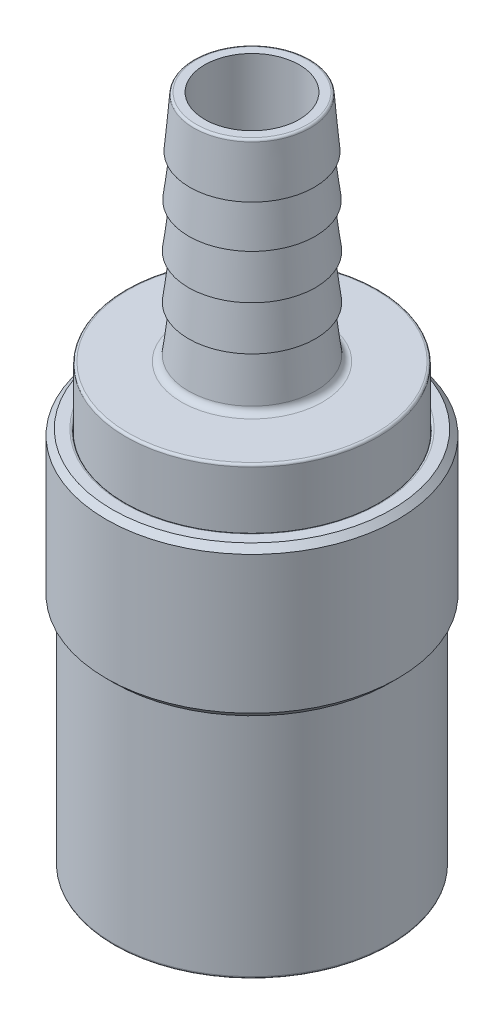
ISO-10303-21;
HEADER;
FILE_DESCRIPTION(('STEP AP214'),'2;1');
FILE_NAME('part.step','',(''),(''),'','','');
FILE_SCHEMA(('AUTOMOTIVE_DESIGN { 1 0 10303 214 1 1 1 1 }'));
ENDSEC;
DATA;
#1=APPLICATION_CONTEXT('core data for automotive mechanical design processes');
#2=APPLICATION_PROTOCOL_DEFINITION('international standard','automotive_design',2000,#1);
#3=PRODUCT_CONTEXT('',#1,'mechanical');
#4=PRODUCT('Part','Part','',(#3));
#5=PRODUCT_RELATED_PRODUCT_CATEGORY('part','',(#4));
#6=PRODUCT_DEFINITION_FORMATION('','',#4);
#7=PRODUCT_DEFINITION_CONTEXT('part definition',#1,'design');
#8=PRODUCT_DEFINITION('design','',#6,#7);
#9=PRODUCT_DEFINITION_SHAPE('','',#8);
#10=(LENGTH_UNIT() NAMED_UNIT(*) SI_UNIT(.MILLI.,.METRE.));
#11=(NAMED_UNIT(*) PLANE_ANGLE_UNIT() SI_UNIT($,.RADIAN.));
#12=(NAMED_UNIT(*) SI_UNIT($,.STERADIAN.) SOLID_ANGLE_UNIT());
#13=UNCERTAINTY_MEASURE_WITH_UNIT(LENGTH_MEASURE(1.E-05),#10,'distance_accuracy_value','');
#14=(GEOMETRIC_REPRESENTATION_CONTEXT(3) GLOBAL_UNCERTAINTY_ASSIGNED_CONTEXT((#13)) GLOBAL_UNIT_ASSIGNED_CONTEXT((#10,
#11,#12)) REPRESENTATION_CONTEXT('',''));
#15=CARTESIAN_POINT('',(0.,0.,0.));
#16=DIRECTION('',(0.,0.,1.));
#17=DIRECTION('',(1.,0.,0.));
#18=AXIS2_PLACEMENT_3D('',#15,#16,#17);
#19=CARTESIAN_POINT('',(0.,0.508,0.));
#20=DIRECTION('',(0.,-1.,0.));
#21=DIRECTION('',(0.,0.,1.));
#22=AXIS2_PLACEMENT_3D('',#19,#20,#21);
#23=CONICAL_SURFACE('',#22,10.541,0.785398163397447);
#24=CARTESIAN_POINT('',(0.,1.016,0.));
#25=DIRECTION('',(0.,1.,0.));
#26=DIRECTION('',(0.,0.,1.));
#27=AXIS2_PLACEMENT_3D('',#24,#25,#26);
#28=CIRCLE('',#27,10.033);
#29=CARTESIAN_POINT('',(0.,1.016,-10.033));
#30=VERTEX_POINT('',#29);
#31=CARTESIAN_POINT('',(0.,1.016,10.033));
#32=VERTEX_POINT('',#31);
#33=EDGE_CURVE('P0_E11',#30,#32,#28,.T.);
#34=ORIENTED_EDGE('',*,*,#33,.T.);
#35=CARTESIAN_POINT('',(0.,1.016,0.));
#36=DIRECTION('',(0.,1.,0.));
#37=DIRECTION('',(0.,0.,1.));
#38=AXIS2_PLACEMENT_3D('',#35,#36,#37);
#39=CIRCLE('',#38,10.033);
#40=EDGE_CURVE('P0_E27',#32,#30,#39,.T.);
#41=ORIENTED_EDGE('',*,*,#40,.T.);
#42=DIRECTION('',(0.,-0.707106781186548,-0.707106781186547));
#43=VECTOR('',#42,1.);
#44=CARTESIAN_POINT('',(0.,0.508,-10.541));
#45=LINE('',#44,#43);
#46=CARTESIAN_POINT('',(0.,0.,-11.049));
#47=VERTEX_POINT('',#46);
#48=EDGE_CURVE('P0_E302',#30,#47,#45,.T.);
#49=ORIENTED_EDGE('',*,*,#48,.T.);
#50=CARTESIAN_POINT('',(0.,0.,0.));
#51=DIRECTION('',(0.,-1.,0.));
#52=DIRECTION('',(0.,0.,1.));
#53=AXIS2_PLACEMENT_3D('',#50,#51,#52);
#54=CIRCLE('',#53,11.049);
#55=EDGE_CURVE('P0_E298',#47,#47,#54,.T.);
#56=ORIENTED_EDGE('',*,*,#55,.T.);
#57=ORIENTED_EDGE('',*,*,#48,.F.);
#58=EDGE_LOOP('',(#34,#41,#49,#56,#57));
#59=FACE_BOUND('',#58,.T.);
#60=ADVANCED_FACE('P0_F16',(#59),#23,.F.);
#61=CARTESIAN_POINT('',(0.,0.,-10.033));
#62=DIRECTION('',(0.,-1.,0.));
#63=DIRECTION('',(0.,0.,-1.));
#64=AXIS2_PLACEMENT_3D('',#61,#62,#63);
#65=PLANE('',#64);
#66=CARTESIAN_POINT('',(0.,0.,0.));
#67=DIRECTION('',(0.,1.,0.));
#68=DIRECTION('',(0.,0.,1.));
#69=AXIS2_PLACEMENT_3D('',#66,#67,#68);
#70=CIRCLE('',#69,11.8618);
#71=CARTESIAN_POINT('',(0.,0.,-11.8618));
#72=VERTEX_POINT('',#71);
#73=CARTESIAN_POINT('',(0.,0.,11.8618));
#74=VERTEX_POINT('',#73);
#75=EDGE_CURVE('P0_E371',#72,#74,#70,.T.);
#76=ORIENTED_EDGE('',*,*,#75,.F.);
#77=CARTESIAN_POINT('',(0.,0.,0.));
#78=DIRECTION('',(0.,1.,0.));
#79=DIRECTION('',(0.,0.,1.));
#80=AXIS2_PLACEMENT_3D('',#77,#78,#79);
#81=CIRCLE('',#80,11.8618);
#82=EDGE_CURVE('P0_E304',#74,#72,#81,.T.);
#83=ORIENTED_EDGE('',*,*,#82,.F.);
#84=EDGE_LOOP('',(#76,#83));
#85=FACE_BOUND('',#84,.T.);
#86=ORIENTED_EDGE('',*,*,#55,.F.);
#87=EDGE_LOOP('',(#86));
#88=FACE_BOUND('',#87,.T.);
#89=ADVANCED_FACE('P0_F780',(#85,#88),#65,.T.);
#90=CARTESIAN_POINT('',(0.,8.5344,0.));
#91=DIRECTION('',(0.,-1.,0.));
#92=DIRECTION('',(0.,0.,-1.));
#93=AXIS2_PLACEMENT_3D('',#90,#91,#92);
#94=CYLINDRICAL_SURFACE('',#93,10.033);
#95=ORIENTED_EDGE('',*,*,#33,.F.);
#96=ORIENTED_EDGE('',*,*,#40,.F.);
#97=DIRECTION('',(0.,1.,0.));
#98=VECTOR('',#97,1.);
#99=CARTESIAN_POINT('',(0.,8.5344,10.033));
#100=LINE('',#99,#98);
#101=CARTESIAN_POINT('',(0.,17.0688,10.033));
#102=VERTEX_POINT('',#101);
#103=EDGE_CURVE('P0_E303',#32,#102,#100,.T.);
#104=ORIENTED_EDGE('',*,*,#103,.T.);
#105=CARTESIAN_POINT('',(0.,17.0688,0.));
#106=DIRECTION('',(0.,-1.,0.));
#107=DIRECTION('',(1.,0.,0.));
#108=AXIS2_PLACEMENT_3D('',#105,#106,#107);
#109=CIRCLE('',#108,10.033);
#110=CARTESIAN_POINT('',(0.,17.0688,-10.033));
#111=VERTEX_POINT('',#110);
#112=EDGE_CURVE('P0_E297',#111,#102,#109,.T.);
#113=ORIENTED_EDGE('',*,*,#112,.F.);
#114=CARTESIAN_POINT('',(0.,17.0688,0.));
#115=DIRECTION('',(0.,-1.,0.));
#116=DIRECTION('',(1.,0.,0.));
#117=AXIS2_PLACEMENT_3D('',#114,#115,#116);
#118=CIRCLE('',#117,10.033);
#119=EDGE_CURVE('P0_E411',#102,#111,#118,.T.);
#120=ORIENTED_EDGE('',*,*,#119,.F.);
#121=ORIENTED_EDGE('',*,*,#103,.F.);
#122=EDGE_LOOP('',(#95,#96,#104,#113,#120,#121));
#123=FACE_BOUND('',#122,.T.);
#124=ADVANCED_FACE('P0_F787',(#123),#94,.F.);
#125=CARTESIAN_POINT('',(0.,48.387,0.));
#126=DIRECTION('',(0.,-1.,0.));
#127=DIRECTION('',(0.,0.,-1.));
#128=AXIS2_PLACEMENT_3D('',#125,#126,#127);
#129=TOROIDAL_SURFACE('',#128,7.6802016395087,0.762);
#130=CARTESIAN_POINT('',(0.,48.298698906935,0.));
#131=DIRECTION('',(0.,-1.,0.));
#132=DIRECTION('',(0.,0.,1.));
#133=AXIS2_PLACEMENT_3D('',#130,#131,#132);
#134=CIRCLE('',#133,6.92333512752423);
#135=CARTESIAN_POINT('',(0.,48.298698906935,-6.92333512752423));
#136=VERTEX_POINT('',#135);
#137=CARTESIAN_POINT('',(0.,48.298698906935,6.92333512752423));
#138=VERTEX_POINT('',#137);
#139=EDGE_CURVE('P0_E339',#136,#138,#134,.T.);
#140=ORIENTED_EDGE('',*,*,#139,.T.);
#141=CARTESIAN_POINT('',(0.,48.387,7.6802016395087));
#142=DIRECTION('',(-1.,0.,0.));
#143=DIRECTION('',(0.,0.,1.));
#144=AXIS2_PLACEMENT_3D('',#141,#142,#143);
#145=CIRCLE('',#144,0.762);
#146=CARTESIAN_POINT('',(0.,47.625,7.6802016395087));
#147=VERTEX_POINT('',#146);
#148=EDGE_CURVE('P0_E382',#138,#147,#145,.T.);
#149=ORIENTED_EDGE('',*,*,#148,.T.);
#150=CARTESIAN_POINT('',(0.,47.625,0.));
#151=DIRECTION('',(0.,1.,0.));
#152=DIRECTION('',(0.,0.,1.));
#153=AXIS2_PLACEMENT_3D('',#150,#151,#152);
#154=CIRCLE('',#153,7.6802016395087);
#155=CARTESIAN_POINT('',(0.,47.625,-7.6802016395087));
#156=VERTEX_POINT('',#155);
#157=EDGE_CURVE('P0_E434',#147,#156,#154,.T.);
#158=ORIENTED_EDGE('',*,*,#157,.T.);
#159=CARTESIAN_POINT('',(0.,47.625,0.));
#160=DIRECTION('',(0.,1.,0.));
#161=DIRECTION('',(0.,0.,1.));
#162=AXIS2_PLACEMENT_3D('',#159,#160,#161);
#163=CIRCLE('',#162,7.6802016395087);
#164=EDGE_CURVE('P0_E336',#156,#147,#163,.T.);
#165=ORIENTED_EDGE('',*,*,#164,.T.);
#166=ORIENTED_EDGE('',*,*,#148,.F.);
#167=CARTESIAN_POINT('',(0.,48.298698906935,0.));
#168=DIRECTION('',(0.,-1.,0.));
#169=DIRECTION('',(0.,0.,1.));
#170=AXIS2_PLACEMENT_3D('',#167,#168,#169);
#171=CIRCLE('',#170,6.92333512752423);
#172=EDGE_CURVE('P0_E332',#138,#136,#171,.T.);
#173=ORIENTED_EDGE('',*,*,#172,.T.);
#174=EDGE_LOOP('',(#140,#149,#158,#165,#166,#173));
#175=FACE_BOUND('',#174,.T.);
#176=ADVANCED_FACE('P0_F531',(#175),#129,.F.);
#177=CARTESIAN_POINT('',(0.,47.625,-13.7414));
#178=DIRECTION('',(0.,1.,0.));
#179=DIRECTION('',(1.,0.,0.));
#180=AXIS2_PLACEMENT_3D('',#177,#178,#179);
#181=PLANE('',#180);
#182=CARTESIAN_POINT('',(0.,47.625,0.));
#183=DIRECTION('',(0.,-1.,0.));
#184=DIRECTION('',(0.,0.,1.));
#185=AXIS2_PLACEMENT_3D('',#182,#183,#184);
#186=CIRCLE('',#185,13.4874);
#187=CARTESIAN_POINT('',(0.,47.625,-13.4874));
#188=VERTEX_POINT('',#187);
#189=CARTESIAN_POINT('',(0.,47.625,13.4874));
#190=VERTEX_POINT('',#189);
#191=EDGE_CURVE('P0_E276',#188,#190,#186,.T.);
#192=ORIENTED_EDGE('',*,*,#191,.F.);
#193=CARTESIAN_POINT('',(0.,47.625,0.));
#194=DIRECTION('',(0.,-1.,0.));
#195=DIRECTION('',(0.,0.,1.));
#196=AXIS2_PLACEMENT_3D('',#193,#194,#195);
#197=CIRCLE('',#196,13.4874);
#198=EDGE_CURVE('P0_E284',#190,#188,#197,.T.);
#199=ORIENTED_EDGE('',*,*,#198,.F.);
#200=EDGE_LOOP('',(#192,#199));
#201=FACE_BOUND('',#200,.T.);
#202=ORIENTED_EDGE('',*,*,#164,.F.);
#203=ORIENTED_EDGE('',*,*,#157,.F.);
#204=EDGE_LOOP('',(#202,#203));
#205=FACE_BOUND('',#204,.T.);
#206=ADVANCED_FACE('P0_F527',(#201,#205),#181,.T.);
#207=CARTESIAN_POINT('',(0.,50.419,0.));
#208=DIRECTION('',(0.,-1.,0.));
#209=DIRECTION('',(0.,0.,-1.));
#210=AXIS2_PLACEMENT_3D('',#207,#208,#209);
#211=CONICAL_SURFACE('',#210,6.67596666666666,0.116141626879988);
#212=ORIENTED_EDGE('',*,*,#139,.F.);
#213=ORIENTED_EDGE('',*,*,#172,.F.);
#214=DIRECTION('',(0.,0.993263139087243,-0.115880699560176));
#215=VECTOR('',#214,1.);
#216=CARTESIAN_POINT('',(0.,50.419,6.67596666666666));
#217=LINE('',#216,#215);
#218=CARTESIAN_POINT('',(0.,53.213,6.35));
#219=VERTEX_POINT('',#218);
#220=EDGE_CURVE('P0_E337',#138,#219,#217,.T.);
#221=ORIENTED_EDGE('',*,*,#220,.T.);
#222=CARTESIAN_POINT('',(0.,53.213,0.));
#223=DIRECTION('',(0.,-1.,0.));
#224=DIRECTION('',(1.,0.,0.));
#225=AXIS2_PLACEMENT_3D('',#222,#223,#224);
#226=CIRCLE('',#225,6.35);
#227=CARTESIAN_POINT('',(0.,53.213,-6.35));
#228=VERTEX_POINT('',#227);
#229=EDGE_CURVE('P0_E370',#219,#228,#226,.T.);
#230=ORIENTED_EDGE('',*,*,#229,.T.);
#231=CARTESIAN_POINT('',(0.,53.213,0.));
#232=DIRECTION('',(0.,-1.,0.));
#233=DIRECTION('',(1.,0.,0.));
#234=AXIS2_PLACEMENT_3D('',#231,#232,#233);
#235=CIRCLE('',#234,6.35);
#236=EDGE_CURVE('P0_E366',#228,#219,#235,.T.);
#237=ORIENTED_EDGE('',*,*,#236,.T.);
#238=ORIENTED_EDGE('',*,*,#220,.F.);
#239=EDGE_LOOP('',(#212,#213,#221,#230,#237,#238));
#240=FACE_BOUND('',#239,.T.);
#241=ADVANCED_FACE('P0_F530',(#240),#211,.T.);
#242=CARTESIAN_POINT('',(0.,0.254,0.));
#243=DIRECTION('',(0.,-1.,0.));
#244=DIRECTION('',(0.,0.,-1.));
#245=AXIS2_PLACEMENT_3D('',#242,#243,#244);
#246=TOROIDAL_SURFACE('',#245,11.8618,0.254);
#247=ORIENTED_EDGE('',*,*,#75,.T.);
#248=CARTESIAN_POINT('',(0.,0.254,11.8618));
#249=DIRECTION('',(-1.,0.,0.));
#250=DIRECTION('',(0.,0.,1.));
#251=AXIS2_PLACEMENT_3D('',#248,#249,#250);
#252=CIRCLE('',#251,0.254);
#253=CARTESIAN_POINT('',(0.,0.254,12.1158));
#254=VERTEX_POINT('',#253);
#255=EDGE_CURVE('P0_E426',#74,#254,#252,.T.);
#256=ORIENTED_EDGE('',*,*,#255,.T.);
#257=CARTESIAN_POINT('',(0.,0.254,0.));
#258=DIRECTION('',(0.,-1.,0.));
#259=DIRECTION('',(0.,0.,1.));
#260=AXIS2_PLACEMENT_3D('',#257,#258,#259);
#261=CIRCLE('',#260,12.1158);
#262=CARTESIAN_POINT('',(0.,0.254,-12.1158));
#263=VERTEX_POINT('',#262);
#264=EDGE_CURVE('P0_E331',#254,#263,#261,.T.);
#265=ORIENTED_EDGE('',*,*,#264,.T.);
#266=CARTESIAN_POINT('',(0.,0.254,0.));
#267=DIRECTION('',(0.,-1.,0.));
#268=DIRECTION('',(0.,0.,1.));
#269=AXIS2_PLACEMENT_3D('',#266,#267,#268);
#270=CIRCLE('',#269,12.1158);
#271=EDGE_CURVE('P0_E308',#263,#254,#270,.T.);
#272=ORIENTED_EDGE('',*,*,#271,.T.);
#273=ORIENTED_EDGE('',*,*,#255,.F.);
#274=ORIENTED_EDGE('',*,*,#82,.T.);
#275=EDGE_LOOP('',(#247,#256,#265,#272,#273,#274));
#276=FACE_BOUND('',#275,.T.);
#277=ADVANCED_FACE('P0_F794',(#276),#246,.T.);
#278=CARTESIAN_POINT('',(0.,8.1153,0.));
#279=DIRECTION('',(0.,-1.,0.));
#280=DIRECTION('',(0.,0.,-1.));
#281=AXIS2_PLACEMENT_3D('',#278,#279,#280);
#282=CYLINDRICAL_SURFACE('',#281,12.1158);
#283=ORIENTED_EDGE('',*,*,#271,.F.);
#284=ORIENTED_EDGE('',*,*,#264,.F.);
#285=DIRECTION('',(0.,1.,0.));
#286=VECTOR('',#285,1.);
#287=CARTESIAN_POINT('',(0.,8.1153,12.1158));
#288=LINE('',#287,#286);
#289=CARTESIAN_POINT('',(0.,16.2306,12.1158));
#290=VERTEX_POINT('',#289);
#291=EDGE_CURVE('P0_E309',#254,#290,#288,.T.);
#292=ORIENTED_EDGE('',*,*,#291,.T.);
#293=CARTESIAN_POINT('',(0.,16.2306,0.));
#294=DIRECTION('',(0.,-1.,0.));
#295=DIRECTION('',(1.,0.,0.));
#296=AXIS2_PLACEMENT_3D('',#293,#294,#295);
#297=CIRCLE('',#296,12.1158);
#298=CARTESIAN_POINT('',(0.,16.2306,-12.1158));
#299=VERTEX_POINT('',#298);
#300=EDGE_CURVE('P0_E344',#290,#299,#297,.T.);
#301=ORIENTED_EDGE('',*,*,#300,.T.);
#302=CARTESIAN_POINT('',(0.,16.2306,0.));
#303=DIRECTION('',(0.,-1.,0.));
#304=DIRECTION('',(1.,0.,0.));
#305=AXIS2_PLACEMENT_3D('',#302,#303,#304);
#306=CIRCLE('',#305,12.1158);
#307=EDGE_CURVE('P0_E359',#299,#290,#306,.T.);
#308=ORIENTED_EDGE('',*,*,#307,.T.);
#309=ORIENTED_EDGE('',*,*,#291,.F.);
#310=EDGE_LOOP('',(#283,#284,#292,#301,#308,#309));
#311=FACE_BOUND('',#310,.T.);
#312=ADVANCED_FACE('P0_F800',(#311),#282,.T.);
#313=CARTESIAN_POINT('',(0.,16.4846,0.));
#314=DIRECTION('',(0.,-1.,0.));
#315=DIRECTION('',(0.,0.,-1.));
#316=AXIS2_PLACEMENT_3D('',#313,#314,#315);
#317=TOROIDAL_SURFACE('',#316,13.4874,0.254);
#318=CARTESIAN_POINT('',(0.,16.2306,0.));
#319=DIRECTION('',(0.,1.,0.));
#320=DIRECTION('',(0.,0.,1.));
#321=AXIS2_PLACEMENT_3D('',#318,#319,#320);
#322=CIRCLE('',#321,13.4874);
#323=CARTESIAN_POINT('',(0.,16.2306,-13.4874));
#324=VERTEX_POINT('',#323);
#325=CARTESIAN_POINT('',(0.,16.2306,13.4874));
#326=VERTEX_POINT('',#325);
#327=EDGE_CURVE('P0_E355',#324,#326,#322,.T.);
#328=ORIENTED_EDGE('',*,*,#327,.T.);
#329=CARTESIAN_POINT('',(0.,16.4846,13.4874));
#330=DIRECTION('',(-1.,0.,0.));
#331=DIRECTION('',(0.,0.,1.));
#332=AXIS2_PLACEMENT_3D('',#329,#330,#331);
#333=CIRCLE('',#332,0.254);
#334=CARTESIAN_POINT('',(0.,16.4846,13.7414));
#335=VERTEX_POINT('',#334);
#336=EDGE_CURVE('P0_E360',#326,#335,#333,.T.);
#337=ORIENTED_EDGE('',*,*,#336,.T.);
#338=CARTESIAN_POINT('',(0.,16.4846,0.));
#339=DIRECTION('',(0.,-1.,0.));
#340=DIRECTION('',(0.,0.,1.));
#341=AXIS2_PLACEMENT_3D('',#338,#339,#340);
#342=CIRCLE('',#341,13.7414);
#343=CARTESIAN_POINT('',(0.,16.4846,-13.7414));
#344=VERTEX_POINT('',#343);
#345=EDGE_CURVE('P0_E430',#335,#344,#342,.T.);
#346=ORIENTED_EDGE('',*,*,#345,.T.);
#347=CARTESIAN_POINT('',(0.,16.4846,0.));
#348=DIRECTION('',(0.,-1.,0.));
#349=DIRECTION('',(0.,0.,1.));
#350=AXIS2_PLACEMENT_3D('',#347,#348,#349);
#351=CIRCLE('',#350,13.7414);
#352=EDGE_CURVE('P0_E500',#344,#335,#351,.T.);
#353=ORIENTED_EDGE('',*,*,#352,.T.);
#354=ORIENTED_EDGE('',*,*,#336,.F.);
#355=CARTESIAN_POINT('',(0.,16.2306,0.));
#356=DIRECTION('',(0.,1.,0.));
#357=DIRECTION('',(0.,0.,1.));
#358=AXIS2_PLACEMENT_3D('',#355,#356,#357);
#359=CIRCLE('',#358,13.4874);
#360=EDGE_CURVE('P0_E479',#326,#324,#359,.T.);
#361=ORIENTED_EDGE('',*,*,#360,.T.);
#362=EDGE_LOOP('',(#328,#337,#346,#353,#354,#361));
#363=FACE_BOUND('',#362,.T.);
#364=ADVANCED_FACE('P0_F837',(#363),#317,.T.);
#365=CARTESIAN_POINT('',(0.,31.9278,0.));
#366=DIRECTION('',(0.,-1.,0.));
#367=DIRECTION('',(0.,0.,-1.));
#368=AXIS2_PLACEMENT_3D('',#365,#366,#367);
#369=CYLINDRICAL_SURFACE('',#368,13.7414);
#370=ORIENTED_EDGE('',*,*,#352,.F.);
#371=ORIENTED_EDGE('',*,*,#345,.F.);
#372=DIRECTION('',(0.,1.,0.));
#373=VECTOR('',#372,1.);
#374=CARTESIAN_POINT('',(0.,31.9278,13.7414));
#375=LINE('',#374,#373);
#376=CARTESIAN_POINT('',(0.,47.371,13.7414));
#377=VERTEX_POINT('',#376);
#378=EDGE_CURVE('P0_E267',#335,#377,#375,.T.);
#379=ORIENTED_EDGE('',*,*,#378,.T.);
#380=CARTESIAN_POINT('',(0.,47.371,0.));
#381=DIRECTION('',(0.,1.,0.));
#382=DIRECTION('',(0.,0.,1.));
#383=AXIS2_PLACEMENT_3D('',#380,#381,#382);
#384=CIRCLE('',#383,13.7414);
#385=CARTESIAN_POINT('',(0.,47.371,-13.7414));
#386=VERTEX_POINT('',#385);
#387=EDGE_CURVE('P0_E263',#386,#377,#384,.T.);
#388=ORIENTED_EDGE('',*,*,#387,.F.);
#389=CARTESIAN_POINT('',(0.,47.371,0.));
#390=DIRECTION('',(0.,1.,0.));
#391=DIRECTION('',(0.,0.,1.));
#392=AXIS2_PLACEMENT_3D('',#389,#390,#391);
#393=CIRCLE('',#392,13.7414);
#394=EDGE_CURVE('P0_E258',#377,#386,#393,.T.);
#395=ORIENTED_EDGE('',*,*,#394,.F.);
#396=ORIENTED_EDGE('',*,*,#378,.F.);
#397=EDGE_LOOP('',(#370,#371,#379,#388,#395,#396));
#398=FACE_BOUND('',#397,.T.);
#399=ADVANCED_FACE('P0_F265',(#398),#369,.T.);
#400=CARTESIAN_POINT('',(0.,16.2306,-12.1158));
#401=DIRECTION('',(0.,-1.,0.));
#402=DIRECTION('',(0.,0.,-1.));
#403=AXIS2_PLACEMENT_3D('',#400,#401,#402);
#404=PLANE('',#403);
#405=ORIENTED_EDGE('',*,*,#327,.F.);
#406=ORIENTED_EDGE('',*,*,#360,.F.);
#407=EDGE_LOOP('',(#405,#406));
#408=FACE_BOUND('',#407,.T.);
#409=ORIENTED_EDGE('',*,*,#307,.F.);
#410=ORIENTED_EDGE('',*,*,#300,.F.);
#411=EDGE_LOOP('',(#409,#410));
#412=FACE_BOUND('',#411,.T.);
#413=ADVANCED_FACE('P0_F823',(#408,#412),#404,.T.);
#414=CARTESIAN_POINT('',(0.,47.371,0.));
#415=DIRECTION('',(0.,-1.,0.));
#416=DIRECTION('',(0.,0.,-1.));
#417=AXIS2_PLACEMENT_3D('',#414,#415,#416);
#418=TOROIDAL_SURFACE('',#417,13.4874,0.254);
#419=ORIENTED_EDGE('',*,*,#387,.T.);
#420=CARTESIAN_POINT('',(0.,47.371,13.4874));
#421=DIRECTION('',(-1.,0.,0.));
#422=DIRECTION('',(0.,0.,1.));
#423=AXIS2_PLACEMENT_3D('',#420,#421,#422);
#424=CIRCLE('',#423,0.254);
#425=EDGE_CURVE('P0_E272',#377,#190,#424,.T.);
#426=ORIENTED_EDGE('',*,*,#425,.T.);
#427=ORIENTED_EDGE('',*,*,#198,.T.);
#428=ORIENTED_EDGE('',*,*,#191,.T.);
#429=ORIENTED_EDGE('',*,*,#425,.F.);
#430=ORIENTED_EDGE('',*,*,#394,.T.);
#431=EDGE_LOOP('',(#419,#426,#427,#428,#429,#430));
#432=FACE_BOUND('',#431,.T.);
#433=ADVANCED_FACE('P0_F274',(#432),#418,.T.);
#434=CARTESIAN_POINT('',(0.,72.771,0.));
#435=DIRECTION('',(0.,-1.,0.));
#436=DIRECTION('',(0.,0.,-1.));
#437=AXIS2_PLACEMENT_3D('',#434,#435,#436);
#438=TOROIDAL_SURFACE('',#437,6.08023053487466,0.254);
#439=CARTESIAN_POINT('',(0.,72.79219630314,0.));
#440=DIRECTION('',(0.,1.,0.));
#441=DIRECTION('',(0.,0.,1.));
#442=AXIS2_PLACEMENT_3D('',#439,#440,#441);
#443=CIRCLE('',#442,6.3333445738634);
#444=CARTESIAN_POINT('',(0.,72.79219630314,-6.3333445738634));
#445=VERTEX_POINT('',#444);
#446=CARTESIAN_POINT('',(0.,72.79219630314,6.3333445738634));
#447=VERTEX_POINT('',#446);
#448=EDGE_CURVE('P0_E277',#445,#447,#443,.T.);
#449=ORIENTED_EDGE('',*,*,#448,.T.);
#450=CARTESIAN_POINT('',(0.,72.771,6.08023053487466));
#451=DIRECTION('',(-1.,0.,0.));
#452=DIRECTION('',(0.,0.,1.));
#453=AXIS2_PLACEMENT_3D('',#450,#451,#452);
#454=CIRCLE('',#453,0.254);
#455=CARTESIAN_POINT('',(0.,73.025,6.08023053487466));
#456=VERTEX_POINT('',#455);
#457=EDGE_CURVE('P0_E287',#447,#456,#454,.T.);
#458=ORIENTED_EDGE('',*,*,#457,.T.);
#459=CARTESIAN_POINT('',(0.,73.025,0.));
#460=DIRECTION('',(0.,-1.,0.));
#461=DIRECTION('',(0.,0.,1.));
#462=AXIS2_PLACEMENT_3D('',#459,#460,#461);
#463=CIRCLE('',#462,6.08023053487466);
#464=CARTESIAN_POINT('',(0.,73.025,-6.08023053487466));
#465=VERTEX_POINT('',#464);
#466=EDGE_CURVE('P0_E440',#456,#465,#463,.T.);
#467=ORIENTED_EDGE('',*,*,#466,.T.);
#468=CARTESIAN_POINT('',(0.,73.025,0.));
#469=DIRECTION('',(0.,-1.,0.));
#470=DIRECTION('',(0.,0.,1.));
#471=AXIS2_PLACEMENT_3D('',#468,#469,#470);
#472=CIRCLE('',#471,6.08023053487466);
#473=EDGE_CURVE('P0_E443',#465,#456,#472,.T.);
#474=ORIENTED_EDGE('',*,*,#473,.T.);
#475=ORIENTED_EDGE('',*,*,#457,.F.);
#476=CARTESIAN_POINT('',(0.,72.79219630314,0.));
#477=DIRECTION('',(0.,1.,0.));
#478=DIRECTION('',(0.,0.,1.));
#479=AXIS2_PLACEMENT_3D('',#476,#477,#478);
#480=CIRCLE('',#479,6.3333445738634);
#481=EDGE_CURVE('P0_E291',#447,#445,#480,.T.);
#482=ORIENTED_EDGE('',*,*,#481,.T.);
#483=EDGE_LOOP('',(#449,#458,#467,#474,#475,#482));
#484=FACE_BOUND('',#483,.T.);
#485=ADVANCED_FACE('P0_F822',(#484),#438,.T.);
#486=CARTESIAN_POINT('',(0.,73.025,-6.31384910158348));
#487=DIRECTION('',(0.,1.,0.));
#488=DIRECTION('',(1.,0.,0.));
#489=AXIS2_PLACEMENT_3D('',#486,#487,#488);
#490=PLANE('',#489);
#491=ORIENTED_EDGE('',*,*,#473,.F.);
#492=ORIENTED_EDGE('',*,*,#466,.F.);
#493=EDGE_LOOP('',(#491,#492));
#494=FACE_BOUND('',#493,.T.);
#495=CARTESIAN_POINT('',(0.,73.025,0.));
#496=DIRECTION('',(0.,-1.,0.));
#497=DIRECTION('',(1.,0.,0.));
#498=AXIS2_PLACEMENT_3D('',#495,#496,#497);
#499=CIRCLE('',#498,5.1562);
#500=CARTESIAN_POINT('',(0.,73.025,-5.1562));
#501=VERTEX_POINT('',#500);
#502=CARTESIAN_POINT('',(0.,73.025,5.1562));
#503=VERTEX_POINT('',#502);
#504=EDGE_CURVE('P0_E494',#501,#503,#499,.T.);
#505=ORIENTED_EDGE('',*,*,#504,.T.);
#506=CARTESIAN_POINT('',(0.,73.025,0.));
#507=DIRECTION('',(0.,-1.,0.));
#508=DIRECTION('',(1.,0.,0.));
#509=AXIS2_PLACEMENT_3D('',#506,#507,#508);
#510=CIRCLE('',#509,5.1562);
#511=EDGE_CURVE('P0_E386',#503,#501,#510,.T.);
#512=ORIENTED_EDGE('',*,*,#511,.T.);
#513=EDGE_LOOP('',(#505,#512));
#514=FACE_BOUND('',#513,.T.);
#515=ADVANCED_FACE('P0_F18',(#494,#514),#490,.T.);
#516=CARTESIAN_POINT('',(0.,70.231,0.));
#517=DIRECTION('',(0.,-1.,0.));
#518=DIRECTION('',(0.,0.,-1.));
#519=AXIS2_PLACEMENT_3D('',#516,#517,#518);
#520=CONICAL_SURFACE('',#519,6.54782455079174,0.0835471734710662);
#521=CARTESIAN_POINT('',(0.,67.437,0.));
#522=DIRECTION('',(0.,-1.,0.));
#523=DIRECTION('',(1.,0.,0.));
#524=AXIS2_PLACEMENT_3D('',#521,#522,#523);
#525=CIRCLE('',#524,6.7818);
#526=CARTESIAN_POINT('',(0.,67.437,-6.7818));
#527=VERTEX_POINT('',#526);
#528=CARTESIAN_POINT('',(0.,67.437,6.7818));
#529=VERTEX_POINT('',#528);
#530=EDGE_CURVE('P0_E321',#527,#529,#525,.T.);
#531=ORIENTED_EDGE('',*,*,#530,.F.);
#532=CARTESIAN_POINT('',(0.,67.437,0.));
#533=DIRECTION('',(0.,-1.,0.));
#534=DIRECTION('',(1.,0.,0.));
#535=AXIS2_PLACEMENT_3D('',#532,#533,#534);
#536=CIRCLE('',#535,6.7818);
#537=EDGE_CURVE('P0_E326',#529,#527,#536,.T.);
#538=ORIENTED_EDGE('',*,*,#537,.F.);
#539=DIRECTION('',(0.,0.996511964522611,-0.0834500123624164));
#540=VECTOR('',#539,1.);
#541=CARTESIAN_POINT('',(0.,70.231,6.54782455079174));
#542=LINE('',#541,#540);
#543=EDGE_CURVE('P0_E353',#529,#447,#542,.T.);
#544=ORIENTED_EDGE('',*,*,#543,.T.);
#545=ORIENTED_EDGE('',*,*,#448,.F.);
#546=ORIENTED_EDGE('',*,*,#481,.F.);
#547=ORIENTED_EDGE('',*,*,#543,.F.);
#548=EDGE_LOOP('',(#531,#538,#544,#545,#546,#547));
#549=FACE_BOUND('',#548,.T.);
#550=ADVANCED_FACE('P0_F819',(#549),#520,.T.);
#551=CARTESIAN_POINT('',(0.,27.8638,0.));
#552=DIRECTION('',(0.,-1.,0.));
#553=DIRECTION('',(0.,0.,-1.));
#554=AXIS2_PLACEMENT_3D('',#551,#552,#553);
#555=CYLINDRICAL_SURFACE('',#554,7.9248);
#556=CARTESIAN_POINT('',(0.,23.9776,0.));
#557=DIRECTION('',(0.,-1.,0.));
#558=DIRECTION('',(1.,0.,0.));
#559=AXIS2_PLACEMENT_3D('',#556,#557,#558);
#560=CIRCLE('',#559,7.9248);
#561=CARTESIAN_POINT('',(0.,23.9776,-7.9248));
#562=VERTEX_POINT('',#561);
#563=CARTESIAN_POINT('',(0.,23.9776,7.9248));
#564=VERTEX_POINT('',#563);
#565=EDGE_CURVE('P0_E349',#562,#564,#560,.T.);
#566=ORIENTED_EDGE('',*,*,#565,.T.);
#567=DIRECTION('',(0.,1.,0.));
#568=VECTOR('',#567,1.);
#569=CARTESIAN_POINT('',(0.,27.8638,7.9248));
#570=LINE('',#569,#568);
#571=CARTESIAN_POINT('',(0.,31.75,7.9248));
#572=VERTEX_POINT('',#571);
#573=EDGE_CURVE('P0_E354',#564,#572,#570,.T.);
#574=ORIENTED_EDGE('',*,*,#573,.T.);
#575=CARTESIAN_POINT('',(0.,31.75,0.));
#576=DIRECTION('',(0.,-1.,0.));
#577=DIRECTION('',(1.,0.,0.));
#578=AXIS2_PLACEMENT_3D('',#575,#576,#577);
#579=CIRCLE('',#578,7.9248);
#580=CARTESIAN_POINT('',(0.,31.75,-7.9248));
#581=VERTEX_POINT('',#580);
#582=EDGE_CURVE('P0_E379',#581,#572,#579,.T.);
#583=ORIENTED_EDGE('',*,*,#582,.F.);
#584=CARTESIAN_POINT('',(0.,31.75,0.));
#585=DIRECTION('',(0.,-1.,0.));
#586=DIRECTION('',(1.,0.,0.));
#587=AXIS2_PLACEMENT_3D('',#584,#585,#586);
#588=CIRCLE('',#587,7.9248);
#589=EDGE_CURVE('P0_E482',#572,#581,#588,.T.);
#590=ORIENTED_EDGE('',*,*,#589,.F.);
#591=ORIENTED_EDGE('',*,*,#573,.F.);
#592=CARTESIAN_POINT('',(0.,23.9776,0.));
#593=DIRECTION('',(0.,-1.,0.));
#594=DIRECTION('',(1.,0.,0.));
#595=AXIS2_PLACEMENT_3D('',#592,#593,#594);
#596=CIRCLE('',#595,7.9248);
#597=EDGE_CURVE('P0_E375',#564,#562,#596,.T.);
#598=ORIENTED_EDGE('',*,*,#597,.T.);
#599=EDGE_LOOP('',(#566,#574,#583,#590,#591,#598));
#600=FACE_BOUND('',#599,.T.);
#601=ADVANCED_FACE('P0_F842',(#600),#555,.F.);
#602=CARTESIAN_POINT('',(0.,31.75,-5.1562));
#603=DIRECTION('',(0.,-1.,0.));
#604=DIRECTION('',(0.,0.,-1.));
#605=AXIS2_PLACEMENT_3D('',#602,#603,#604);
#606=PLANE('',#605);
#607=ORIENTED_EDGE('',*,*,#582,.T.);
#608=ORIENTED_EDGE('',*,*,#589,.T.);
#609=EDGE_LOOP('',(#607,#608));
#610=FACE_BOUND('',#609,.T.);
#611=CARTESIAN_POINT('',(0.,31.75,0.));
#612=DIRECTION('',(0.,-1.,0.));
#613=DIRECTION('',(1.,0.,0.));
#614=AXIS2_PLACEMENT_3D('',#611,#612,#613);
#615=CIRCLE('',#614,5.1562);
#616=CARTESIAN_POINT('',(0.,31.75,-5.1562));
#617=VERTEX_POINT('',#616);
#618=CARTESIAN_POINT('',(0.,31.75,5.1562));
#619=VERTEX_POINT('',#618);
#620=EDGE_CURVE('P0_E487',#617,#619,#615,.T.);
#621=ORIENTED_EDGE('',*,*,#620,.F.);
#622=CARTESIAN_POINT('',(0.,31.75,0.));
#623=DIRECTION('',(0.,-1.,0.));
#624=DIRECTION('',(1.,0.,0.));
#625=AXIS2_PLACEMENT_3D('',#622,#623,#624);
#626=CIRCLE('',#625,5.1562);
#627=EDGE_CURVE('P0_E325',#619,#617,#626,.T.);
#628=ORIENTED_EDGE('',*,*,#627,.F.);
#629=EDGE_LOOP('',(#621,#628));
#630=FACE_BOUND('',#629,.T.);
#631=ADVANCED_FACE('P0_F742',(#610,#630),#606,.T.);
#632=CARTESIAN_POINT('',(0.,52.3875,0.));
#633=DIRECTION('',(0.,-1.,0.));
#634=DIRECTION('',(0.,0.,-1.));
#635=AXIS2_PLACEMENT_3D('',#632,#633,#634);
#636=CYLINDRICAL_SURFACE('',#635,5.1562);
#637=ORIENTED_EDGE('',*,*,#620,.T.);
#638=DIRECTION('',(0.,1.,0.));
#639=VECTOR('',#638,1.);
#640=CARTESIAN_POINT('',(0.,52.3875,5.1562));
#641=LINE('',#640,#639);
#642=EDGE_CURVE('P0_E483',#619,#503,#641,.T.);
#643=ORIENTED_EDGE('',*,*,#642,.T.);
#644=ORIENTED_EDGE('',*,*,#504,.F.);
#645=ORIENTED_EDGE('',*,*,#511,.F.);
#646=ORIENTED_EDGE('',*,*,#642,.F.);
#647=ORIENTED_EDGE('',*,*,#627,.T.);
#648=EDGE_LOOP('',(#637,#643,#644,#645,#646,#647));
#649=FACE_BOUND('',#648,.T.);
#650=ADVANCED_FACE('P0_F740',(#649),#636,.F.);
#651=CARTESIAN_POINT('',(0.,67.437,-6.35));
#652=DIRECTION('',(0.,-1.,0.));
#653=DIRECTION('',(0.,0.,-1.));
#654=AXIS2_PLACEMENT_3D('',#651,#652,#653);
#655=PLANE('',#654);
#656=ORIENTED_EDGE('',*,*,#530,.T.);
#657=ORIENTED_EDGE('',*,*,#537,.T.);
#658=EDGE_LOOP('',(#656,#657));
#659=FACE_BOUND('',#658,.T.);
#660=CARTESIAN_POINT('',(0.,67.437,0.));
#661=DIRECTION('',(0.,-1.,0.));
#662=DIRECTION('',(1.,0.,0.));
#663=AXIS2_PLACEMENT_3D('',#660,#661,#662);
#664=CIRCLE('',#663,6.35);
#665=CARTESIAN_POINT('',(0.,67.437,-6.35));
#666=VERTEX_POINT('',#665);
#667=CARTESIAN_POINT('',(0.,67.437,6.35));
#668=VERTEX_POINT('',#667);
#669=EDGE_CURVE('P0_E315',#666,#668,#664,.T.);
#670=ORIENTED_EDGE('',*,*,#669,.F.);
#671=CARTESIAN_POINT('',(0.,67.437,0.));
#672=DIRECTION('',(0.,-1.,0.));
#673=DIRECTION('',(1.,0.,0.));
#674=AXIS2_PLACEMENT_3D('',#671,#672,#673);
#675=CIRCLE('',#674,6.35);
#676=EDGE_CURVE('P0_E310',#668,#666,#675,.T.);
#677=ORIENTED_EDGE('',*,*,#676,.F.);
#678=EDGE_LOOP('',(#670,#677));
#679=FACE_BOUND('',#678,.T.);
#680=ADVANCED_FACE('P0_F751',(#659,#679),#655,.T.);
#681=CARTESIAN_POINT('',(0.,65.151,0.));
#682=DIRECTION('',(0.,-1.,0.));
#683=DIRECTION('',(0.,0.,-1.));
#684=AXIS2_PLACEMENT_3D('',#681,#682,#683);
#685=CONICAL_SURFACE('',#684,6.6167,0.116141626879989);
#686=CARTESIAN_POINT('',(0.,62.865,0.));
#687=DIRECTION('',(0.,-1.,0.));
#688=DIRECTION('',(1.,0.,0.));
#689=AXIS2_PLACEMENT_3D('',#686,#687,#688);
#690=CIRCLE('',#689,6.8834);
#691=CARTESIAN_POINT('',(0.,62.865,-6.8834));
#692=VERTEX_POINT('',#691);
#693=CARTESIAN_POINT('',(0.,62.865,6.8834));
#694=VERTEX_POINT('',#693);
#695=EDGE_CURVE('P0_E348',#692,#694,#690,.T.);
#696=ORIENTED_EDGE('',*,*,#695,.F.);
#697=CARTESIAN_POINT('',(0.,62.865,0.));
#698=DIRECTION('',(0.,-1.,0.));
#699=DIRECTION('',(1.,0.,0.));
#700=AXIS2_PLACEMENT_3D('',#697,#698,#699);
#701=CIRCLE('',#700,6.8834);
#702=EDGE_CURVE('P0_E319',#694,#692,#701,.T.);
#703=ORIENTED_EDGE('',*,*,#702,.F.);
#704=DIRECTION('',(0.,0.993263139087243,-0.115880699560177));
#705=VECTOR('',#704,1.);
#706=CARTESIAN_POINT('',(0.,65.151,6.6167));
#707=LINE('',#706,#705);
#708=EDGE_CURVE('P0_E314',#694,#668,#707,.T.);
#709=ORIENTED_EDGE('',*,*,#708,.T.);
#710=ORIENTED_EDGE('',*,*,#676,.T.);
#711=ORIENTED_EDGE('',*,*,#669,.T.);
#712=ORIENTED_EDGE('',*,*,#708,.F.);
#713=EDGE_LOOP('',(#696,#703,#709,#710,#711,#712));
#714=FACE_BOUND('',#713,.T.);
#715=ADVANCED_FACE('P0_F754',(#714),#685,.T.);
#716=CARTESIAN_POINT('',(0.,62.865,-6.35));
#717=DIRECTION('',(0.,-1.,0.));
#718=DIRECTION('',(0.,0.,-1.));
#719=AXIS2_PLACEMENT_3D('',#716,#717,#718);
#720=PLANE('',#719);
#721=ORIENTED_EDGE('',*,*,#695,.T.);
#722=ORIENTED_EDGE('',*,*,#702,.T.);
#723=EDGE_LOOP('',(#721,#722));
#724=FACE_BOUND('',#723,.T.);
#725=CARTESIAN_POINT('',(0.,62.865,0.));
#726=DIRECTION('',(0.,-1.,0.));
#727=DIRECTION('',(1.,0.,0.));
#728=AXIS2_PLACEMENT_3D('',#725,#726,#727);
#729=CIRCLE('',#728,6.35);
#730=CARTESIAN_POINT('',(0.,62.865,-6.35));
#731=VERTEX_POINT('',#730);
#732=CARTESIAN_POINT('',(0.,62.865,6.35));
#733=VERTEX_POINT('',#732);
#734=EDGE_CURVE('P0_E395',#731,#733,#729,.T.);
#735=ORIENTED_EDGE('',*,*,#734,.F.);
#736=CARTESIAN_POINT('',(0.,62.865,0.));
#737=DIRECTION('',(0.,-1.,0.));
#738=DIRECTION('',(1.,0.,0.));
#739=AXIS2_PLACEMENT_3D('',#736,#737,#738);
#740=CIRCLE('',#739,6.35);
#741=EDGE_CURVE('P0_E320',#733,#731,#740,.T.);
#742=ORIENTED_EDGE('',*,*,#741,.F.);
#743=EDGE_LOOP('',(#735,#742));
#744=FACE_BOUND('',#743,.T.);
#745=ADVANCED_FACE('P0_F756',(#724,#744),#720,.T.);
#746=CARTESIAN_POINT('',(0.,60.452,0.));
#747=DIRECTION('',(0.,-1.,0.));
#748=DIRECTION('',(0.,0.,-1.));
#749=AXIS2_PLACEMENT_3D('',#746,#747,#748);
#750=CONICAL_SURFACE('',#749,6.63151666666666,0.116141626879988);
#751=CARTESIAN_POINT('',(0.,58.039,0.));
#752=DIRECTION('',(0.,-1.,0.));
#753=DIRECTION('',(1.,0.,0.));
#754=AXIS2_PLACEMENT_3D('',#751,#752,#753);
#755=CIRCLE('',#754,6.91303333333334);
#756=CARTESIAN_POINT('',(0.,58.039,-6.91303333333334));
#757=VERTEX_POINT('',#756);
#758=CARTESIAN_POINT('',(0.,58.039,6.91303333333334));
#759=VERTEX_POINT('',#758);
#760=EDGE_CURVE('P0_E388',#757,#759,#755,.T.);
#761=ORIENTED_EDGE('',*,*,#760,.F.);
#762=CARTESIAN_POINT('',(0.,58.039,0.));
#763=DIRECTION('',(0.,-1.,0.));
#764=DIRECTION('',(1.,0.,0.));
#765=AXIS2_PLACEMENT_3D('',#762,#763,#764);
#766=CIRCLE('',#765,6.91303333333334);
#767=EDGE_CURVE('P0_E232',#759,#757,#766,.T.);
#768=ORIENTED_EDGE('',*,*,#767,.F.);
#769=DIRECTION('',(0.,0.993263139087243,-0.115880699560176));
#770=VECTOR('',#769,1.);
#771=CARTESIAN_POINT('',(0.,60.452,6.63151666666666));
#772=LINE('',#771,#770);
#773=EDGE_CURVE('P0_E316',#759,#733,#772,.T.);
#774=ORIENTED_EDGE('',*,*,#773,.T.);
#775=ORIENTED_EDGE('',*,*,#741,.T.);
#776=ORIENTED_EDGE('',*,*,#734,.T.);
#777=ORIENTED_EDGE('',*,*,#773,.F.);
#778=EDGE_LOOP('',(#761,#768,#774,#775,#776,#777));
#779=FACE_BOUND('',#778,.T.);
#780=ADVANCED_FACE('P0_F759',(#779),#750,.T.);
#781=CARTESIAN_POINT('',(0.,58.039,-6.35));
#782=DIRECTION('',(0.,-1.,0.));
#783=DIRECTION('',(0.,0.,-1.));
#784=AXIS2_PLACEMENT_3D('',#781,#782,#783);
#785=PLANE('',#784);
#786=ORIENTED_EDGE('',*,*,#760,.T.);
#787=ORIENTED_EDGE('',*,*,#767,.T.);
#788=EDGE_LOOP('',(#786,#787));
#789=FACE_BOUND('',#788,.T.);
#790=CARTESIAN_POINT('',(0.,58.039,0.));
#791=DIRECTION('',(0.,-1.,0.));
#792=DIRECTION('',(1.,0.,0.));
#793=AXIS2_PLACEMENT_3D('',#790,#791,#792);
#794=CIRCLE('',#793,6.35);
#795=CARTESIAN_POINT('',(0.,58.039,-6.35));
#796=VERTEX_POINT('',#795);
#797=CARTESIAN_POINT('',(0.,58.039,6.35));
#798=VERTEX_POINT('',#797);
#799=EDGE_CURVE('P0_E242',#796,#798,#794,.T.);
#800=ORIENTED_EDGE('',*,*,#799,.F.);
#801=CARTESIAN_POINT('',(0.,58.039,0.));
#802=DIRECTION('',(0.,-1.,0.));
#803=DIRECTION('',(1.,0.,0.));
#804=AXIS2_PLACEMENT_3D('',#801,#802,#803);
#805=CIRCLE('',#804,6.35);
#806=EDGE_CURVE('P0_E374',#798,#796,#805,.T.);
#807=ORIENTED_EDGE('',*,*,#806,.F.);
#808=EDGE_LOOP('',(#800,#807));
#809=FACE_BOUND('',#808,.T.);
#810=ADVANCED_FACE('P0_F764',(#789,#809),#785,.T.);
#811=CARTESIAN_POINT('',(0.,55.626,0.));
#812=DIRECTION('',(0.,-1.,0.));
#813=DIRECTION('',(0.,0.,-1.));
#814=AXIS2_PLACEMENT_3D('',#811,#812,#813);
#815=CONICAL_SURFACE('',#814,6.63151666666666,0.116141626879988);
#816=CARTESIAN_POINT('',(0.,53.213,0.));
#817=DIRECTION('',(0.,-1.,0.));
#818=DIRECTION('',(1.,0.,0.));
#819=AXIS2_PLACEMENT_3D('',#816,#817,#818);
#820=CIRCLE('',#819,6.91303333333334);
#821=CARTESIAN_POINT('',(0.,53.213,-6.91303333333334));
#822=VERTEX_POINT('',#821);
#823=CARTESIAN_POINT('',(0.,53.213,6.91303333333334));
#824=VERTEX_POINT('',#823);
#825=EDGE_CURVE('P0_E20',#822,#824,#820,.T.);
#826=ORIENTED_EDGE('',*,*,#825,.F.);
#827=CARTESIAN_POINT('',(0.,53.213,0.));
#828=DIRECTION('',(0.,-1.,0.));
#829=DIRECTION('',(1.,0.,0.));
#830=AXIS2_PLACEMENT_3D('',#827,#828,#829);
#831=CIRCLE('',#830,6.91303333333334);
#832=EDGE_CURVE('P0_E293',#824,#822,#831,.T.);
#833=ORIENTED_EDGE('',*,*,#832,.F.);
#834=DIRECTION('',(0.,0.993263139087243,-0.115880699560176));
#835=VECTOR('',#834,1.);
#836=CARTESIAN_POINT('',(0.,55.626,6.63151666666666));
#837=LINE('',#836,#835);
#838=EDGE_CURVE('P0_E389',#824,#798,#837,.T.);
#839=ORIENTED_EDGE('',*,*,#838,.T.);
#840=ORIENTED_EDGE('',*,*,#806,.T.);
#841=ORIENTED_EDGE('',*,*,#799,.T.);
#842=ORIENTED_EDGE('',*,*,#838,.F.);
#843=EDGE_LOOP('',(#826,#833,#839,#840,#841,#842));
#844=FACE_BOUND('',#843,.T.);
#845=ADVANCED_FACE('P0_F766',(#844),#815,.T.);
#846=CARTESIAN_POINT('',(0.,53.213,-6.35));
#847=DIRECTION('',(0.,-1.,0.));
#848=DIRECTION('',(0.,0.,-1.));
#849=AXIS2_PLACEMENT_3D('',#846,#847,#848);
#850=PLANE('',#849);
#851=ORIENTED_EDGE('',*,*,#825,.T.);
#852=ORIENTED_EDGE('',*,*,#832,.T.);
#853=EDGE_LOOP('',(#851,#852));
#854=FACE_BOUND('',#853,.T.);
#855=ORIENTED_EDGE('',*,*,#236,.F.);
#856=ORIENTED_EDGE('',*,*,#229,.F.);
#857=EDGE_LOOP('',(#855,#856));
#858=FACE_BOUND('',#857,.T.);
#859=ADVANCED_FACE('P0_F774',(#854,#858),#850,.T.);
#860=CARTESIAN_POINT('',(0.,17.3863,0.));
#861=DIRECTION('',(0.,1.,0.));
#862=DIRECTION('',(0.,0.,-1.));
#863=AXIS2_PLACEMENT_3D('',#860,#861,#862);
#864=CONICAL_SURFACE('',#863,10.3505,0.78539816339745);
#865=ORIENTED_EDGE('',*,*,#112,.T.);
#866=DIRECTION('',(0.,0.707106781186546,0.707106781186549));
#867=VECTOR('',#866,1.);
#868=CARTESIAN_POINT('',(0.,17.3863,10.3505));
#869=LINE('',#868,#867);
#870=CARTESIAN_POINT('',(0.,17.7038,10.668));
#871=VERTEX_POINT('',#870);
#872=EDGE_CURVE('P0_E407',#102,#871,#869,.T.);
#873=ORIENTED_EDGE('',*,*,#872,.T.);
#874=CARTESIAN_POINT('',(0.,17.7038,0.));
#875=DIRECTION('',(0.,-1.,0.));
#876=DIRECTION('',(1.,0.,0.));
#877=AXIS2_PLACEMENT_3D('',#874,#875,#876);
#878=CIRCLE('',#877,10.668);
#879=CARTESIAN_POINT('',(0.,17.7038,-10.668));
#880=VERTEX_POINT('',#879);
#881=EDGE_CURVE('P0_E450',#880,#871,#878,.T.);
#882=ORIENTED_EDGE('',*,*,#881,.F.);
#883=CARTESIAN_POINT('',(0.,17.7038,0.));
#884=DIRECTION('',(0.,-1.,0.));
#885=DIRECTION('',(1.,0.,0.));
#886=AXIS2_PLACEMENT_3D('',#883,#884,#885);
#887=CIRCLE('',#886,10.668);
#888=EDGE_CURVE('P0_E364',#871,#880,#887,.T.);
#889=ORIENTED_EDGE('',*,*,#888,.F.);
#890=ORIENTED_EDGE('',*,*,#872,.F.);
#891=ORIENTED_EDGE('',*,*,#119,.T.);
#892=EDGE_LOOP('',(#865,#873,#882,#889,#890,#891));
#893=FACE_BOUND('',#892,.T.);
#894=ADVANCED_FACE('P0_F808',(#893),#864,.F.);
#895=CARTESIAN_POINT('',(0.,20.8407,0.));
#896=DIRECTION('',(0.,-1.,0.));
#897=DIRECTION('',(0.,0.,-1.));
#898=AXIS2_PLACEMENT_3D('',#895,#896,#897);
#899=CYLINDRICAL_SURFACE('',#898,10.668);
#900=ORIENTED_EDGE('',*,*,#881,.T.);
#901=DIRECTION('',(0.,1.,0.));
#902=VECTOR('',#901,1.);
#903=CARTESIAN_POINT('',(0.,20.8407,10.668));
#904=LINE('',#903,#902);
#905=CARTESIAN_POINT('',(0.,23.9776,10.668));
#906=VERTEX_POINT('',#905);
#907=EDGE_CURVE('P0_E446',#871,#906,#904,.T.);
#908=ORIENTED_EDGE('',*,*,#907,.T.);
#909=CARTESIAN_POINT('',(0.,23.9776,0.));
#910=DIRECTION('',(0.,-1.,0.));
#911=DIRECTION('',(1.,0.,0.));
#912=AXIS2_PLACEMENT_3D('',#909,#910,#911);
#913=CIRCLE('',#912,10.668);
#914=CARTESIAN_POINT('',(0.,23.9776,-10.668));
#915=VERTEX_POINT('',#914);
#916=EDGE_CURVE('P0_E361',#915,#906,#913,.T.);
#917=ORIENTED_EDGE('',*,*,#916,.F.);
#918=CARTESIAN_POINT('',(0.,23.9776,0.));
#919=DIRECTION('',(0.,-1.,0.));
#920=DIRECTION('',(1.,0.,0.));
#921=AXIS2_PLACEMENT_3D('',#918,#919,#920);
#922=CIRCLE('',#921,10.668);
#923=EDGE_CURVE('P0_E365',#906,#915,#922,.T.);
#924=ORIENTED_EDGE('',*,*,#923,.F.);
#925=ORIENTED_EDGE('',*,*,#907,.F.);
#926=ORIENTED_EDGE('',*,*,#888,.T.);
#927=EDGE_LOOP('',(#900,#908,#917,#924,#925,#926));
#928=FACE_BOUND('',#927,.T.);
#929=ADVANCED_FACE('P0_F815',(#928),#899,.F.);
#930=CARTESIAN_POINT('',(0.,23.9776,-7.9248));
#931=DIRECTION('',(0.,-1.,0.));
#932=DIRECTION('',(0.,0.,-1.));
#933=AXIS2_PLACEMENT_3D('',#930,#931,#932);
#934=PLANE('',#933);
#935=ORIENTED_EDGE('',*,*,#916,.T.);
#936=ORIENTED_EDGE('',*,*,#923,.T.);
#937=EDGE_LOOP('',(#935,#936));
#938=FACE_BOUND('',#937,.T.);
#939=ORIENTED_EDGE('',*,*,#565,.F.);
#940=ORIENTED_EDGE('',*,*,#597,.F.);
#941=EDGE_LOOP('',(#939,#940));
#942=FACE_BOUND('',#941,.T.);
#943=ADVANCED_FACE('P0_F846',(#938,#942),#934,.T.);
#944=CLOSED_SHELL('',(#60,#89,#124,#176,#206,#241,#277,#312,#364,#399,#413,#433,#485,#515,#550,
#601,#631,#650,#680,#715,#745,#780,#810,#845,#859,#894,#929,#943));
#945=MANIFOLD_SOLID_BREP('P0_B1',#944);
#946=CARTESIAN_POINT('',(0.,40.9575,0.));
#947=DIRECTION('',(0.,-1.,0.));
#948=DIRECTION('',(0.,0.,1.));
#949=AXIS2_PLACEMENT_3D('',#946,#947,#948);
#950=CONICAL_SURFACE('',#949,15.5448,0.785398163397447);
#951=CARTESIAN_POINT('',(0.,40.64,0.));
#952=DIRECTION('',(0.,1.,0.));
#953=DIRECTION('',(0.,0.,1.));
#954=AXIS2_PLACEMENT_3D('',#951,#952,#953);
#955=CIRCLE('',#954,15.8623);
#956=CARTESIAN_POINT('',(0.,40.64,-15.8623));
#957=VERTEX_POINT('',#956);
#958=CARTESIAN_POINT('',(0.,40.64,15.8623));
#959=VERTEX_POINT('',#958);
#960=EDGE_CURVE('P1_E10',#957,#959,#955,.T.);
#961=ORIENTED_EDGE('',*,*,#960,.T.);
#962=CARTESIAN_POINT('',(0.,40.64,0.));
#963=DIRECTION('',(0.,1.,0.));
#964=DIRECTION('',(0.,0.,1.));
#965=AXIS2_PLACEMENT_3D('',#962,#963,#964);
#966=CIRCLE('',#965,15.8623);
#967=EDGE_CURVE('P1_E26',#959,#957,#966,.T.);
#968=ORIENTED_EDGE('',*,*,#967,.T.);
#969=DIRECTION('',(0.,0.707106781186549,0.707106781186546));
#970=VECTOR('',#969,1.);
#971=CARTESIAN_POINT('',(0.,40.9575,-15.5448));
#972=LINE('',#971,#970);
#973=CARTESIAN_POINT('',(0.,41.275,-15.2273));
#974=VERTEX_POINT('',#973);
#975=EDGE_CURVE('P1_E232',#957,#974,#972,.T.);
#976=ORIENTED_EDGE('',*,*,#975,.T.);
#977=CARTESIAN_POINT('',(0.,41.275,0.));
#978=DIRECTION('',(0.,-1.,0.));
#979=DIRECTION('',(0.,0.,1.));
#980=AXIS2_PLACEMENT_3D('',#977,#978,#979);
#981=CIRCLE('',#980,15.2273);
#982=EDGE_CURVE('P1_E228',#974,#974,#981,.T.);
#983=ORIENTED_EDGE('',*,*,#982,.T.);
#984=ORIENTED_EDGE('',*,*,#975,.F.);
#985=EDGE_LOOP('',(#961,#968,#976,#983,#984));
#986=FACE_BOUND('',#985,.T.);
#987=ADVANCED_FACE('P1_F15',(#986),#950,.T.);
#988=CARTESIAN_POINT('',(0.,41.275,-15.8623));
#989=DIRECTION('',(0.,1.,0.));
#990=DIRECTION('',(1.,0.,0.));
#991=AXIS2_PLACEMENT_3D('',#988,#989,#990);
#992=PLANE('',#991);
#993=ORIENTED_EDGE('',*,*,#982,.F.);
#994=EDGE_LOOP('',(#993));
#995=FACE_BOUND('',#994,.T.);
#996=CARTESIAN_POINT('',(0.,41.275,0.));
#997=DIRECTION('',(0.,1.,0.));
#998=DIRECTION('',(0.,0.,1.));
#999=AXIS2_PLACEMENT_3D('',#996,#997,#998);
#1000=CIRCLE('',#999,14.0335);
#1001=CARTESIAN_POINT('',(0.,41.275,-14.0335));
#1002=VERTEX_POINT('',#1001);
#1003=CARTESIAN_POINT('',(0.,41.275,14.0335));
#1004=VERTEX_POINT('',#1003);
#1005=EDGE_CURVE('P1_E175',#1002,#1004,#1000,.T.);
#1006=ORIENTED_EDGE('',*,*,#1005,.F.);
#1007=CARTESIAN_POINT('',(0.,41.275,0.));
#1008=DIRECTION('',(0.,1.,0.));
#1009=DIRECTION('',(0.,0.,1.));
#1010=AXIS2_PLACEMENT_3D('',#1007,#1008,#1009);
#1011=CIRCLE('',#1010,14.0335);
#1012=EDGE_CURVE('P1_E227',#1004,#1002,#1011,.T.);
#1013=ORIENTED_EDGE('',*,*,#1012,.F.);
#1014=EDGE_LOOP('',(#1006,#1013));
#1015=FACE_BOUND('',#1014,.T.);
#1016=ADVANCED_FACE('P1_F401',(#995,#1015),#992,.T.);
#1017=CARTESIAN_POINT('',(0.,33.4645,0.));
#1018=DIRECTION('',(0.,-1.,0.));
#1019=DIRECTION('',(0.,0.,-1.));
#1020=AXIS2_PLACEMENT_3D('',#1017,#1018,#1019);
#1021=CYLINDRICAL_SURFACE('',#1020,15.8623);
#1022=CARTESIAN_POINT('',(0.,25.654,0.));
#1023=DIRECTION('',(0.,-1.,0.));
#1024=DIRECTION('',(1.,0.,0.));
#1025=AXIS2_PLACEMENT_3D('',#1022,#1023,#1024);
#1026=CIRCLE('',#1025,15.8623);
#1027=CARTESIAN_POINT('',(0.,25.654,-15.8623));
#1028=VERTEX_POINT('',#1027);
#1029=CARTESIAN_POINT('',(0.,25.654,15.8623));
#1030=VERTEX_POINT('',#1029);
#1031=EDGE_CURVE('P1_E222',#1028,#1030,#1026,.T.);
#1032=ORIENTED_EDGE('',*,*,#1031,.F.);
#1033=CARTESIAN_POINT('',(0.,25.654,0.));
#1034=DIRECTION('',(0.,-1.,0.));
#1035=DIRECTION('',(1.,0.,0.));
#1036=AXIS2_PLACEMENT_3D('',#1033,#1034,#1035);
#1037=CIRCLE('',#1036,15.8623);
#1038=EDGE_CURVE('P1_E218',#1030,#1028,#1037,.T.);
#1039=ORIENTED_EDGE('',*,*,#1038,.F.);
#1040=DIRECTION('',(0.,1.,0.));
#1041=VECTOR('',#1040,1.);
#1042=CARTESIAN_POINT('',(0.,33.4645,15.8623));
#1043=LINE('',#1042,#1041);
#1044=EDGE_CURVE('P1_E233',#1030,#959,#1043,.T.);
#1045=ORIENTED_EDGE('',*,*,#1044,.T.);
#1046=ORIENTED_EDGE('',*,*,#960,.F.);
#1047=ORIENTED_EDGE('',*,*,#967,.F.);
#1048=ORIENTED_EDGE('',*,*,#1044,.F.);
#1049=EDGE_LOOP('',(#1032,#1039,#1045,#1046,#1047,#1048));
#1050=FACE_BOUND('',#1049,.T.);
#1051=ADVANCED_FACE('P1_F392',(#1050),#1021,.T.);
#1052=CARTESIAN_POINT('',(0.,4.953,0.));
#1053=DIRECTION('',(0.,-1.,0.));
#1054=DIRECTION('',(0.,0.,-1.));
#1055=AXIS2_PLACEMENT_3D('',#1052,#1053,#1054);
#1056=TOROIDAL_SURFACE('',#1055,12.446,0.254);
#1057=CARTESIAN_POINT('',(0.,5.207,0.));
#1058=DIRECTION('',(0.,1.,0.));
#1059=DIRECTION('',(0.,0.,1.));
#1060=AXIS2_PLACEMENT_3D('',#1057,#1058,#1059);
#1061=CIRCLE('',#1060,12.446);
#1062=CARTESIAN_POINT('',(0.,5.207,-12.446));
#1063=VERTEX_POINT('',#1062);
#1064=CARTESIAN_POINT('',(0.,5.207,12.446));
#1065=VERTEX_POINT('',#1064);
#1066=EDGE_CURVE('P1_E19',#1063,#1065,#1061,.T.);
#1067=ORIENTED_EDGE('',*,*,#1066,.T.);
#1068=CARTESIAN_POINT('',(0.,4.953,12.446));
#1069=DIRECTION('',(-1.,0.,0.));
#1070=DIRECTION('',(0.,0.,1.));
#1071=AXIS2_PLACEMENT_3D('',#1068,#1069,#1070);
#1072=CIRCLE('',#1071,0.254);
#1073=CARTESIAN_POINT('',(0.,4.953,12.192));
#1074=VERTEX_POINT('',#1073);
#1075=EDGE_CURVE('P1_E215',#1065,#1074,#1072,.T.);
#1076=ORIENTED_EDGE('',*,*,#1075,.T.);
#1077=CARTESIAN_POINT('',(0.,4.953,0.));
#1078=DIRECTION('',(0.,-1.,0.));
#1079=DIRECTION('',(0.,0.,1.));
#1080=AXIS2_PLACEMENT_3D('',#1077,#1078,#1079);
#1081=CIRCLE('',#1080,12.192);
#1082=CARTESIAN_POINT('',(0.,4.953,-12.192));
#1083=VERTEX_POINT('',#1082);
#1084=EDGE_CURVE('P1_E157',#1074,#1083,#1081,.T.);
#1085=ORIENTED_EDGE('',*,*,#1084,.T.);
#1086=CARTESIAN_POINT('',(0.,4.953,0.));
#1087=DIRECTION('',(0.,-1.,0.));
#1088=DIRECTION('',(0.,0.,1.));
#1089=AXIS2_PLACEMENT_3D('',#1086,#1087,#1088);
#1090=CIRCLE('',#1089,12.192);
#1091=EDGE_CURVE('P1_E216',#1083,#1074,#1090,.T.);
#1092=ORIENTED_EDGE('',*,*,#1091,.T.);
#1093=ORIENTED_EDGE('',*,*,#1075,.F.);
#1094=CARTESIAN_POINT('',(0.,5.207,0.));
#1095=DIRECTION('',(0.,1.,0.));
#1096=DIRECTION('',(0.,0.,1.));
#1097=AXIS2_PLACEMENT_3D('',#1094,#1095,#1096);
#1098=CIRCLE('',#1097,12.446);
#1099=EDGE_CURVE('P1_E160',#1065,#1063,#1098,.T.);
#1100=ORIENTED_EDGE('',*,*,#1099,.T.);
#1101=EDGE_LOOP('',(#1067,#1076,#1085,#1092,#1093,#1100));
#1102=FACE_BOUND('',#1101,.T.);
#1103=ADVANCED_FACE('P1_F390',(#1102),#1056,.T.);
#1104=CARTESIAN_POINT('',(0.,2.6035,0.));
#1105=DIRECTION('',(0.,-1.,0.));
#1106=DIRECTION('',(0.,0.,-1.));
#1107=AXIS2_PLACEMENT_3D('',#1104,#1105,#1106);
#1108=CYLINDRICAL_SURFACE('',#1107,12.192);
#1109=CARTESIAN_POINT('',(0.,0.254,0.));
#1110=DIRECTION('',(0.,1.,0.));
#1111=DIRECTION('',(0.,0.,1.));
#1112=AXIS2_PLACEMENT_3D('',#1109,#1110,#1111);
#1113=CIRCLE('',#1112,12.192);
#1114=CARTESIAN_POINT('',(0.,0.254,-12.192));
#1115=VERTEX_POINT('',#1114);
#1116=CARTESIAN_POINT('',(0.,0.254,12.192));
#1117=VERTEX_POINT('',#1116);
#1118=EDGE_CURVE('P1_E144',#1115,#1117,#1113,.T.);
#1119=ORIENTED_EDGE('',*,*,#1118,.F.);
#1120=CARTESIAN_POINT('',(0.,0.254,0.));
#1121=DIRECTION('',(0.,1.,0.));
#1122=DIRECTION('',(0.,0.,1.));
#1123=AXIS2_PLACEMENT_3D('',#1120,#1121,#1122);
#1124=CIRCLE('',#1123,12.192);
#1125=EDGE_CURVE('P1_E138',#1117,#1115,#1124,.T.);
#1126=ORIENTED_EDGE('',*,*,#1125,.F.);
#1127=DIRECTION('',(0.,1.,0.));
#1128=VECTOR('',#1127,1.);
#1129=CARTESIAN_POINT('',(0.,2.6035,12.192));
#1130=LINE('',#1129,#1128);
#1131=EDGE_CURVE('P1_E143',#1117,#1074,#1130,.T.);
#1132=ORIENTED_EDGE('',*,*,#1131,.T.);
#1133=ORIENTED_EDGE('',*,*,#1091,.F.);
#1134=ORIENTED_EDGE('',*,*,#1084,.F.);
#1135=ORIENTED_EDGE('',*,*,#1131,.F.);
#1136=EDGE_LOOP('',(#1119,#1126,#1132,#1133,#1134,#1135));
#1137=FACE_BOUND('',#1136,.T.);
#1138=ADVANCED_FACE('P1_F140',(#1137),#1108,.F.);
#1139=CARTESIAN_POINT('',(0.,5.207,-13.7795));
#1140=DIRECTION('',(0.,1.,0.));
#1141=DIRECTION('',(1.,0.,0.));
#1142=AXIS2_PLACEMENT_3D('',#1139,#1140,#1141);
#1143=PLANE('',#1142);
#1144=CARTESIAN_POINT('',(0.,5.207,0.));
#1145=DIRECTION('',(0.,-1.,0.));
#1146=DIRECTION('',(1.,0.,0.));
#1147=AXIS2_PLACEMENT_3D('',#1144,#1145,#1146);
#1148=CIRCLE('',#1147,13.7795);
#1149=CARTESIAN_POINT('',(0.,5.207,-13.7795));
#1150=VERTEX_POINT('',#1149);
#1151=CARTESIAN_POINT('',(0.,5.207,13.7795));
#1152=VERTEX_POINT('',#1151);
#1153=EDGE_CURVE('P1_E212',#1150,#1152,#1148,.T.);
#1154=ORIENTED_EDGE('',*,*,#1153,.F.);
#1155=CARTESIAN_POINT('',(0.,5.207,0.));
#1156=DIRECTION('',(0.,-1.,0.));
#1157=DIRECTION('',(1.,0.,0.));
#1158=AXIS2_PLACEMENT_3D('',#1155,#1156,#1157);
#1159=CIRCLE('',#1158,13.7795);
#1160=EDGE_CURVE('P1_E213',#1152,#1150,#1159,.T.);
#1161=ORIENTED_EDGE('',*,*,#1160,.F.);
#1162=EDGE_LOOP('',(#1154,#1161));
#1163=FACE_BOUND('',#1162,.T.);
#1164=ORIENTED_EDGE('',*,*,#1066,.F.);
#1165=ORIENTED_EDGE('',*,*,#1099,.F.);
#1166=EDGE_LOOP('',(#1164,#1165));
#1167=FACE_BOUND('',#1166,.T.);
#1168=ADVANCED_FACE('P1_F383',(#1163,#1167),#1143,.T.);
#1169=CARTESIAN_POINT('',(0.,0.254,0.));
#1170=DIRECTION('',(0.,-1.,0.));
#1171=DIRECTION('',(0.,0.,-1.));
#1172=AXIS2_PLACEMENT_3D('',#1169,#1170,#1171);
#1173=TOROIDAL_SURFACE('',#1172,12.446,0.254);
#1174=ORIENTED_EDGE('',*,*,#1118,.T.);
#1175=CARTESIAN_POINT('',(0.,0.254,12.446));
#1176=DIRECTION('',(-1.,0.,0.));
#1177=DIRECTION('',(0.,0.,1.));
#1178=AXIS2_PLACEMENT_3D('',#1175,#1176,#1177);
#1179=CIRCLE('',#1178,0.254);
#1180=CARTESIAN_POINT('',(0.,0.,12.446));
#1181=VERTEX_POINT('',#1180);
#1182=EDGE_CURVE('P1_E152',#1117,#1181,#1179,.T.);
#1183=ORIENTED_EDGE('',*,*,#1182,.T.);
#1184=CARTESIAN_POINT('',(0.,0.,0.));
#1185=DIRECTION('',(0.,-1.,0.));
#1186=DIRECTION('',(0.,0.,1.));
#1187=AXIS2_PLACEMENT_3D('',#1184,#1185,#1186);
#1188=CIRCLE('',#1187,12.446);
#1189=CARTESIAN_POINT('',(0.,0.,-12.446));
#1190=VERTEX_POINT('',#1189);
#1191=EDGE_CURVE('P1_E164',#1181,#1190,#1188,.T.);
#1192=ORIENTED_EDGE('',*,*,#1191,.T.);
#1193=CARTESIAN_POINT('',(0.,0.,0.));
#1194=DIRECTION('',(0.,-1.,0.));
#1195=DIRECTION('',(0.,0.,1.));
#1196=AXIS2_PLACEMENT_3D('',#1193,#1194,#1195);
#1197=CIRCLE('',#1196,12.446);
#1198=EDGE_CURVE('P1_E148',#1190,#1181,#1197,.T.);
#1199=ORIENTED_EDGE('',*,*,#1198,.T.);
#1200=ORIENTED_EDGE('',*,*,#1182,.F.);
#1201=ORIENTED_EDGE('',*,*,#1125,.T.);
#1202=EDGE_LOOP('',(#1174,#1183,#1192,#1199,#1200,#1201));
#1203=FACE_BOUND('',#1202,.T.);
#1204=ADVANCED_FACE('P1_F151',(#1203),#1173,.T.);
#1205=CARTESIAN_POINT('',(0.,0.,-12.192));
#1206=DIRECTION('',(0.,-1.,0.));
#1207=DIRECTION('',(0.,0.,-1.));
#1208=AXIS2_PLACEMENT_3D('',#1205,#1206,#1207);
#1209=PLANE('',#1208);
#1210=CARTESIAN_POINT('',(0.,0.,0.));
#1211=DIRECTION('',(0.,1.,0.));
#1212=DIRECTION('',(0.,0.,1.));
#1213=AXIS2_PLACEMENT_3D('',#1210,#1211,#1212);
#1214=CIRCLE('',#1213,14.8082);
#1215=CARTESIAN_POINT('',(0.,0.,-14.8082));
#1216=VERTEX_POINT('',#1215);
#1217=CARTESIAN_POINT('',(0.,0.,14.8082));
#1218=VERTEX_POINT('',#1217);
#1219=EDGE_CURVE('P1_E130',#1216,#1218,#1214,.T.);
#1220=ORIENTED_EDGE('',*,*,#1219,.F.);
#1221=CARTESIAN_POINT('',(0.,0.,0.));
#1222=DIRECTION('',(0.,1.,0.));
#1223=DIRECTION('',(0.,0.,1.));
#1224=AXIS2_PLACEMENT_3D('',#1221,#1222,#1223);
#1225=CIRCLE('',#1224,14.8082);
#1226=EDGE_CURVE('P1_E123',#1218,#1216,#1225,.T.);
#1227=ORIENTED_EDGE('',*,*,#1226,.F.);
#1228=EDGE_LOOP('',(#1220,#1227));
#1229=FACE_BOUND('',#1228,.T.);
#1230=ORIENTED_EDGE('',*,*,#1198,.F.);
#1231=ORIENTED_EDGE('',*,*,#1191,.F.);
#1232=EDGE_LOOP('',(#1230,#1231));
#1233=FACE_BOUND('',#1232,.T.);
#1234=ADVANCED_FACE('P1_F413',(#1229,#1233),#1209,.T.);
#1235=CARTESIAN_POINT('',(0.,0.254,0.));
#1236=DIRECTION('',(0.,-1.,0.));
#1237=DIRECTION('',(0.,0.,-1.));
#1238=AXIS2_PLACEMENT_3D('',#1235,#1236,#1237);
#1239=TOROIDAL_SURFACE('',#1238,14.8082,0.254);
#1240=ORIENTED_EDGE('',*,*,#1219,.T.);
#1241=CARTESIAN_POINT('',(0.,0.254,14.8082));
#1242=DIRECTION('',(-1.,0.,0.));
#1243=DIRECTION('',(0.,0.,1.));
#1244=AXIS2_PLACEMENT_3D('',#1241,#1242,#1243);
#1245=CIRCLE('',#1244,0.254);
#1246=CARTESIAN_POINT('',(0.,0.254,15.0622));
#1247=VERTEX_POINT('',#1246);
#1248=EDGE_CURVE('P1_E183',#1218,#1247,#1245,.T.);
#1249=ORIENTED_EDGE('',*,*,#1248,.T.);
#1250=CARTESIAN_POINT('',(0.,0.254,0.));
#1251=DIRECTION('',(0.,-1.,0.));
#1252=DIRECTION('',(0.,0.,1.));
#1253=AXIS2_PLACEMENT_3D('',#1250,#1251,#1252);
#1254=CIRCLE('',#1253,15.0622);
#1255=CARTESIAN_POINT('',(0.,0.254,-15.0622));
#1256=VERTEX_POINT('',#1255);
#1257=EDGE_CURVE('P1_E180',#1247,#1256,#1254,.T.);
#1258=ORIENTED_EDGE('',*,*,#1257,.T.);
#1259=CARTESIAN_POINT('',(0.,0.254,0.));
#1260=DIRECTION('',(0.,-1.,0.));
#1261=DIRECTION('',(0.,0.,1.));
#1262=AXIS2_PLACEMENT_3D('',#1259,#1260,#1261);
#1263=CIRCLE('',#1262,15.0622);
#1264=EDGE_CURVE('P1_E184',#1256,#1247,#1263,.T.);
#1265=ORIENTED_EDGE('',*,*,#1264,.T.);
#1266=ORIENTED_EDGE('',*,*,#1248,.F.);
#1267=ORIENTED_EDGE('',*,*,#1226,.T.);
#1268=EDGE_LOOP('',(#1240,#1249,#1258,#1265,#1266,#1267));
#1269=FACE_BOUND('',#1268,.T.);
#1270=ADVANCED_FACE('P1_F17',(#1269),#1239,.T.);
#1271=CARTESIAN_POINT('',(0.,12.42695,0.));
#1272=DIRECTION('',(0.,-1.,0.));
#1273=DIRECTION('',(0.,0.,-1.));
#1274=AXIS2_PLACEMENT_3D('',#1271,#1272,#1273);
#1275=CYLINDRICAL_SURFACE('',#1274,15.0622);
#1276=ORIENTED_EDGE('',*,*,#1264,.F.);
#1277=ORIENTED_EDGE('',*,*,#1257,.F.);
#1278=DIRECTION('',(0.,1.,0.));
#1279=VECTOR('',#1278,1.);
#1280=CARTESIAN_POINT('',(0.,12.42695,15.0622));
#1281=LINE('',#1280,#1279);
#1282=CARTESIAN_POINT('',(0.,24.8539,15.0622));
#1283=VERTEX_POINT('',#1282);
#1284=EDGE_CURVE('P1_E199',#1247,#1283,#1281,.T.);
#1285=ORIENTED_EDGE('',*,*,#1284,.T.);
#1286=CARTESIAN_POINT('',(0.,24.8539,0.));
#1287=DIRECTION('',(0.,-1.,0.));
#1288=DIRECTION('',(1.,0.,0.));
#1289=AXIS2_PLACEMENT_3D('',#1286,#1287,#1288);
#1290=CIRCLE('',#1289,15.0622);
#1291=CARTESIAN_POINT('',(0.,24.8539,-15.0622));
#1292=VERTEX_POINT('',#1291);
#1293=EDGE_CURVE('P1_E205',#1283,#1292,#1290,.T.);
#1294=ORIENTED_EDGE('',*,*,#1293,.T.);
#1295=CARTESIAN_POINT('',(0.,24.8539,0.));
#1296=DIRECTION('',(0.,-1.,0.));
#1297=DIRECTION('',(1.,0.,0.));
#1298=AXIS2_PLACEMENT_3D('',#1295,#1296,#1297);
#1299=CIRCLE('',#1298,15.0622);
#1300=EDGE_CURVE('P1_E178',#1292,#1283,#1299,.T.);
#1301=ORIENTED_EDGE('',*,*,#1300,.T.);
#1302=ORIENTED_EDGE('',*,*,#1284,.F.);
#1303=EDGE_LOOP('',(#1276,#1277,#1285,#1294,#1301,#1302));
#1304=FACE_BOUND('',#1303,.T.);
#1305=ADVANCED_FACE('P1_F269',(#1304),#1275,.T.);
#1306=CARTESIAN_POINT('',(0.,41.021,0.));
#1307=DIRECTION('',(0.,-1.,0.));
#1308=DIRECTION('',(0.,0.,-1.));
#1309=AXIS2_PLACEMENT_3D('',#1306,#1307,#1308);
#1310=TOROIDAL_SURFACE('',#1309,14.0335,0.254);
#1311=ORIENTED_EDGE('',*,*,#1005,.T.);
#1312=CARTESIAN_POINT('',(0.,41.021,14.0335));
#1313=DIRECTION('',(-1.,0.,0.));
#1314=DIRECTION('',(0.,0.,1.));
#1315=AXIS2_PLACEMENT_3D('',#1312,#1313,#1314);
#1316=CIRCLE('',#1315,0.254);
#1317=CARTESIAN_POINT('',(0.,41.021,13.7795));
#1318=VERTEX_POINT('',#1317);
#1319=EDGE_CURVE('P1_E179',#1004,#1318,#1316,.T.);
#1320=ORIENTED_EDGE('',*,*,#1319,.T.);
#1321=CARTESIAN_POINT('',(0.,41.021,0.));
#1322=DIRECTION('',(0.,-1.,0.));
#1323=DIRECTION('',(0.,0.,1.));
#1324=AXIS2_PLACEMENT_3D('',#1321,#1322,#1323);
#1325=CIRCLE('',#1324,13.7795);
#1326=CARTESIAN_POINT('',(0.,41.021,-13.7795));
#1327=VERTEX_POINT('',#1326);
#1328=EDGE_CURVE('P1_E226',#1318,#1327,#1325,.T.);
#1329=ORIENTED_EDGE('',*,*,#1328,.T.);
#1330=CARTESIAN_POINT('',(0.,41.021,0.));
#1331=DIRECTION('',(0.,-1.,0.));
#1332=DIRECTION('',(0.,0.,1.));
#1333=AXIS2_PLACEMENT_3D('',#1330,#1331,#1332);
#1334=CIRCLE('',#1333,13.7795);
#1335=EDGE_CURVE('P1_E223',#1327,#1318,#1334,.T.);
#1336=ORIENTED_EDGE('',*,*,#1335,.T.);
#1337=ORIENTED_EDGE('',*,*,#1319,.F.);
#1338=ORIENTED_EDGE('',*,*,#1012,.T.);
#1339=EDGE_LOOP('',(#1311,#1320,#1329,#1336,#1337,#1338));
#1340=FACE_BOUND('',#1339,.T.);
#1341=ADVANCED_FACE('P1_F377',(#1340),#1310,.T.);
#1342=CARTESIAN_POINT('',(0.,23.241,0.));
#1343=DIRECTION('',(0.,-1.,0.));
#1344=DIRECTION('',(0.,0.,-1.));
#1345=AXIS2_PLACEMENT_3D('',#1342,#1343,#1344);
#1346=CYLINDRICAL_SURFACE('',#1345,13.7795);
#1347=ORIENTED_EDGE('',*,*,#1153,.T.);
#1348=DIRECTION('',(0.,1.,0.));
#1349=VECTOR('',#1348,1.);
#1350=CARTESIAN_POINT('',(0.,23.241,13.7795));
#1351=LINE('',#1350,#1349);
#1352=EDGE_CURVE('P1_E208',#1152,#1318,#1351,.T.);
#1353=ORIENTED_EDGE('',*,*,#1352,.T.);
#1354=ORIENTED_EDGE('',*,*,#1335,.F.);
#1355=ORIENTED_EDGE('',*,*,#1328,.F.);
#1356=ORIENTED_EDGE('',*,*,#1352,.F.);
#1357=ORIENTED_EDGE('',*,*,#1160,.T.);
#1358=EDGE_LOOP('',(#1347,#1353,#1354,#1355,#1356,#1357));
#1359=FACE_BOUND('',#1358,.T.);
#1360=ADVANCED_FACE('P1_F381',(#1359),#1346,.F.);
#1361=CARTESIAN_POINT('',(0.,25.25395,0.));
#1362=DIRECTION('',(0.,1.,0.));
#1363=DIRECTION('',(0.,0.,-1.));
#1364=AXIS2_PLACEMENT_3D('',#1361,#1362,#1363);
#1365=CONICAL_SURFACE('',#1364,15.46225,0.785398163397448);
#1366=ORIENTED_EDGE('',*,*,#1300,.F.);
#1367=ORIENTED_EDGE('',*,*,#1293,.F.);
#1368=DIRECTION('',(0.,0.707106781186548,0.707106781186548));
#1369=VECTOR('',#1368,1.);
#1370=CARTESIAN_POINT('',(0.,25.25395,15.46225));
#1371=LINE('',#1370,#1369);
#1372=EDGE_CURVE('P1_E173',#1283,#1030,#1371,.T.);
#1373=ORIENTED_EDGE('',*,*,#1372,.T.);
#1374=ORIENTED_EDGE('',*,*,#1038,.T.);
#1375=ORIENTED_EDGE('',*,*,#1031,.T.);
#1376=ORIENTED_EDGE('',*,*,#1372,.F.);
#1377=EDGE_LOOP('',(#1366,#1367,#1373,#1374,#1375,#1376));
#1378=FACE_BOUND('',#1377,.T.);
#1379=ADVANCED_FACE('P1_F273',(#1378),#1365,.T.);
#1380=CLOSED_SHELL('',(#987,#1016,#1051,#1103,#1138,#1168,#1204,#1234,#1270,#1305,#1341,#1360,#1379));
#1381=MANIFOLD_SOLID_BREP('P1_B1',#1380);
#1382=ADVANCED_BREP_SHAPE_REPRESENTATION('',(#18,#945,#1381),#14);
#1383=SHAPE_DEFINITION_REPRESENTATION(#9,#1382);
ENDSEC;
END-ISO-10303-21;
